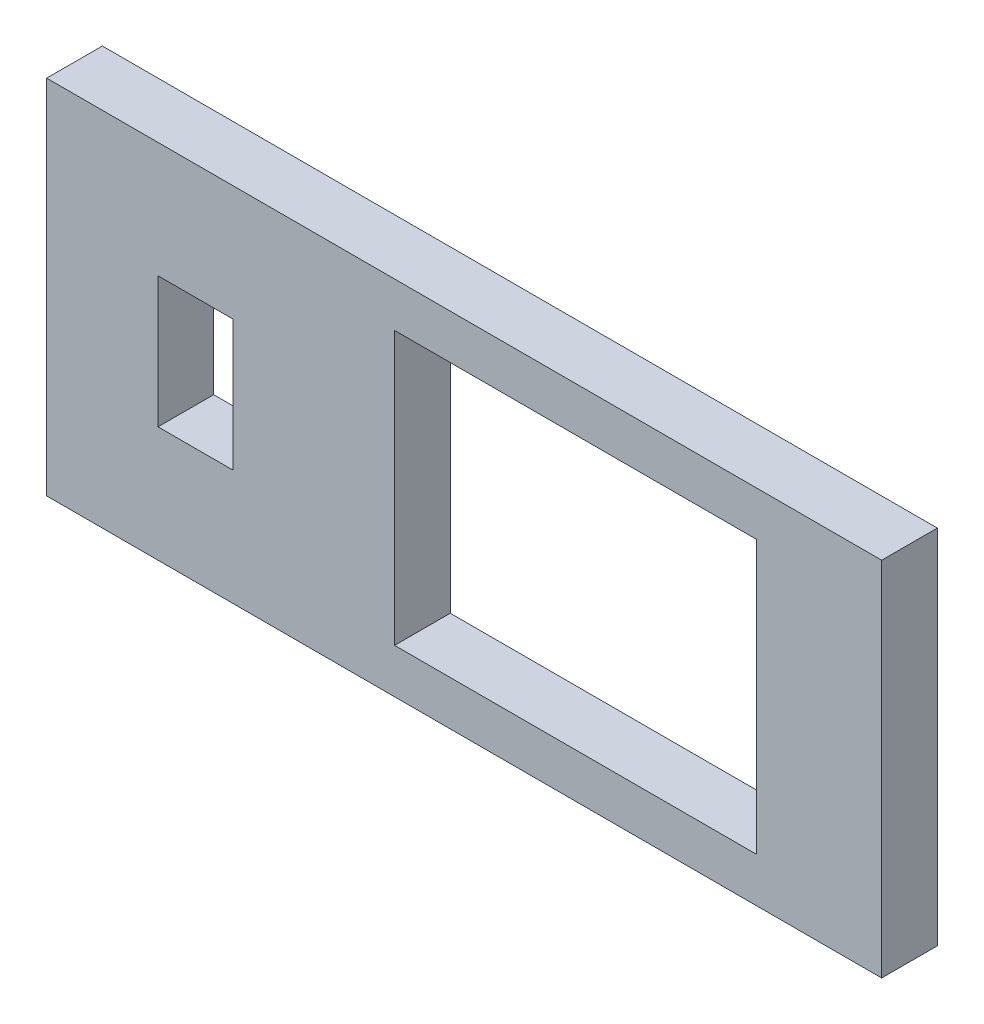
ISO-10303-21;
HEADER;
FILE_DESCRIPTION(('STEP AP214'),'2;1');
FILE_NAME('part.step','',(''),(''),'','','');
FILE_SCHEMA(('AUTOMOTIVE_DESIGN { 1 0 10303 214 1 1 1 1 }'));
ENDSEC;
DATA;
#1=APPLICATION_CONTEXT('core data for automotive mechanical design processes');
#2=APPLICATION_PROTOCOL_DEFINITION('international standard','automotive_design',2000,#1);
#3=PRODUCT_CONTEXT('',#1,'mechanical');
#4=PRODUCT('Part','Part','',(#3));
#5=PRODUCT_RELATED_PRODUCT_CATEGORY('part','',(#4));
#6=PRODUCT_DEFINITION_FORMATION('','',#4);
#7=PRODUCT_DEFINITION_CONTEXT('part definition',#1,'design');
#8=PRODUCT_DEFINITION('design','',#6,#7);
#9=PRODUCT_DEFINITION_SHAPE('','',#8);
#10=(LENGTH_UNIT() NAMED_UNIT(*) SI_UNIT(.MILLI.,.METRE.));
#11=(NAMED_UNIT(*) PLANE_ANGLE_UNIT() SI_UNIT($,.RADIAN.));
#12=(NAMED_UNIT(*) SI_UNIT($,.STERADIAN.) SOLID_ANGLE_UNIT());
#13=UNCERTAINTY_MEASURE_WITH_UNIT(LENGTH_MEASURE(1.E-05),#10,'distance_accuracy_value','');
#14=(GEOMETRIC_REPRESENTATION_CONTEXT(3) GLOBAL_UNCERTAINTY_ASSIGNED_CONTEXT((#13)) GLOBAL_UNIT_ASSIGNED_CONTEXT((#10,
#11,#12)) REPRESENTATION_CONTEXT('',''));
#15=CARTESIAN_POINT('',(0.,0.,0.));
#16=DIRECTION('',(0.,0.,1.));
#17=DIRECTION('',(1.,0.,0.));
#18=AXIS2_PLACEMENT_3D('',#15,#16,#17);
#19=CARTESIAN_POINT('',(0.,130.,0.));
#20=DIRECTION('',(-1.,0.,0.));
#21=DIRECTION('',(0.,0.,1.));
#22=AXIS2_PLACEMENT_3D('',#19,#20,#21);
#23=PLANE('',#22);
#24=DIRECTION('',(0.,0.,-1.));
#25=VECTOR('',#24,1.);
#26=CARTESIAN_POINT('',(0.,0.,0.));
#27=LINE('',#26,#25);
#28=CARTESIAN_POINT('',(0.,0.,20.));
#29=VERTEX_POINT('',#28);
#30=CARTESIAN_POINT('',(0.,0.,0.));
#31=VERTEX_POINT('',#30);
#32=EDGE_CURVE('E180',#29,#31,#27,.T.);
#33=ORIENTED_EDGE('',*,*,#32,.T.);
#34=DIRECTION('',(0.,-1.,0.));
#35=VECTOR('',#34,1.);
#36=CARTESIAN_POINT('',(0.,130.,0.));
#37=LINE('',#36,#35);
#38=CARTESIAN_POINT('',(0.,130.,0.));
#39=VERTEX_POINT('',#38);
#40=EDGE_CURVE('E11',#39,#31,#37,.T.);
#41=ORIENTED_EDGE('',*,*,#40,.F.);
#42=DIRECTION('',(0.,0.,-1.));
#43=VECTOR('',#42,1.);
#44=CARTESIAN_POINT('',(0.,130.,0.));
#45=LINE('',#44,#43);
#46=CARTESIAN_POINT('',(0.,130.,20.));
#47=VERTEX_POINT('',#46);
#48=EDGE_CURVE('E187',#47,#39,#45,.T.);
#49=ORIENTED_EDGE('',*,*,#48,.F.);
#50=DIRECTION('',(0.,-1.,0.));
#51=VECTOR('',#50,1.);
#52=CARTESIAN_POINT('',(0.,130.,20.));
#53=LINE('',#52,#51);
#54=EDGE_CURVE('E197',#47,#29,#53,.T.);
#55=ORIENTED_EDGE('',*,*,#54,.T.);
#56=EDGE_LOOP('',(#33,#41,#49,#55));
#57=FACE_BOUND('',#56,.T.);
#58=ADVANCED_FACE('F32',(#57),#23,.F.);
#59=CARTESIAN_POINT('',(0.,130.,0.));
#60=DIRECTION('',(0.,0.,1.));
#61=DIRECTION('',(1.,0.,0.));
#62=AXIS2_PLACEMENT_3D('',#59,#60,#61);
#63=PLANE('',#62);
#64=DIRECTION('',(0.,-1.,0.));
#65=VECTOR('',#64,1.);
#66=CARTESIAN_POINT('',(-45.,0.,0.));
#67=LINE('',#66,#65);
#68=CARTESIAN_POINT('',(-45.,114.,0.));
#69=VERTEX_POINT('',#68);
#70=CARTESIAN_POINT('',(-45.,16.,0.));
#71=VERTEX_POINT('',#70);
#72=EDGE_CURVE('E125',#69,#71,#67,.T.);
#73=ORIENTED_EDGE('',*,*,#72,.F.);
#74=DIRECTION('',(-1.,0.,0.));
#75=VECTOR('',#74,1.);
#76=CARTESIAN_POINT('',(0.,114.,0.));
#77=LINE('',#76,#75);
#78=CARTESIAN_POINT('',(-175.,114.,0.));
#79=VERTEX_POINT('',#78);
#80=EDGE_CURVE('E122',#69,#79,#77,.T.);
#81=ORIENTED_EDGE('',*,*,#80,.T.);
#82=DIRECTION('',(0.,-1.,0.));
#83=VECTOR('',#82,1.);
#84=CARTESIAN_POINT('',(-175.,0.,0.));
#85=LINE('',#84,#83);
#86=CARTESIAN_POINT('',(-175.,16.,0.));
#87=VERTEX_POINT('',#86);
#88=EDGE_CURVE('E128',#79,#87,#85,.T.);
#89=ORIENTED_EDGE('',*,*,#88,.T.);
#90=DIRECTION('',(-1.,0.,0.));
#91=VECTOR('',#90,1.);
#92=CARTESIAN_POINT('',(0.,16.,0.));
#93=LINE('',#92,#91);
#94=EDGE_CURVE('E132',#71,#87,#93,.T.);
#95=ORIENTED_EDGE('',*,*,#94,.F.);
#96=EDGE_LOOP('',(#73,#81,#89,#95));
#97=FACE_BOUND('',#96,.T.);
#98=DIRECTION('',(1.,0.,0.));
#99=VECTOR('',#98,1.);
#100=CARTESIAN_POINT('',(-260.,41.5,0.));
#101=LINE('',#100,#99);
#102=CARTESIAN_POINT('',(-260.,41.5,0.));
#103=VERTEX_POINT('',#102);
#104=CARTESIAN_POINT('',(-233.,41.5,0.));
#105=VERTEX_POINT('',#104);
#106=EDGE_CURVE('E165',#103,#105,#101,.T.);
#107=ORIENTED_EDGE('',*,*,#106,.T.);
#108=DIRECTION('',(0.,1.,0.));
#109=VECTOR('',#108,1.);
#110=CARTESIAN_POINT('',(-233.,88.5,0.));
#111=LINE('',#110,#109);
#112=CARTESIAN_POINT('',(-233.,88.5,0.));
#113=VERTEX_POINT('',#112);
#114=EDGE_CURVE('E155',#105,#113,#111,.T.);
#115=ORIENTED_EDGE('',*,*,#114,.T.);
#116=DIRECTION('',(-1.,0.,0.));
#117=VECTOR('',#116,1.);
#118=CARTESIAN_POINT('',(-260.,88.5,0.));
#119=LINE('',#118,#117);
#120=CARTESIAN_POINT('',(-260.,88.5,0.));
#121=VERTEX_POINT('',#120);
#122=EDGE_CURVE('E158',#113,#121,#119,.T.);
#123=ORIENTED_EDGE('',*,*,#122,.T.);
#124=DIRECTION('',(0.,-1.,0.));
#125=VECTOR('',#124,1.);
#126=CARTESIAN_POINT('',(-260.,88.5,0.));
#127=LINE('',#126,#125);
#128=EDGE_CURVE('E162',#121,#103,#127,.T.);
#129=ORIENTED_EDGE('',*,*,#128,.T.);
#130=EDGE_LOOP('',(#107,#115,#123,#129));
#131=FACE_BOUND('',#130,.T.);
#132=DIRECTION('',(-1.,0.,0.));
#133=VECTOR('',#132,1.);
#134=CARTESIAN_POINT('',(0.,0.,0.));
#135=LINE('',#134,#133);
#136=CARTESIAN_POINT('',(-300.,0.,0.));
#137=VERTEX_POINT('',#136);
#138=EDGE_CURVE('E200',#31,#137,#135,.T.);
#139=ORIENTED_EDGE('',*,*,#138,.T.);
#140=DIRECTION('',(0.,-1.,0.));
#141=VECTOR('',#140,1.);
#142=CARTESIAN_POINT('',(-300.,130.,0.));
#143=LINE('',#142,#141);
#144=CARTESIAN_POINT('',(-300.,130.,0.));
#145=VERTEX_POINT('',#144);
#146=EDGE_CURVE('E39',#145,#137,#143,.T.);
#147=ORIENTED_EDGE('',*,*,#146,.F.);
#148=DIRECTION('',(-1.,0.,0.));
#149=VECTOR('',#148,1.);
#150=CARTESIAN_POINT('',(0.,130.,0.));
#151=LINE('',#150,#149);
#152=EDGE_CURVE('E190',#39,#145,#151,.T.);
#153=ORIENTED_EDGE('',*,*,#152,.F.);
#154=ORIENTED_EDGE('',*,*,#40,.T.);
#155=EDGE_LOOP('',(#139,#147,#153,#154));
#156=FACE_BOUND('',#155,.T.);
#157=ADVANCED_FACE('F134',(#97,#131,#156),#63,.F.);
#158=CARTESIAN_POINT('',(-300.,130.,0.));
#159=DIRECTION('',(1.,0.,0.));
#160=DIRECTION('',(0.,0.,-1.));
#161=AXIS2_PLACEMENT_3D('',#158,#159,#160);
#162=PLANE('',#161);
#163=DIRECTION('',(0.,0.,1.));
#164=VECTOR('',#163,1.);
#165=CARTESIAN_POINT('',(-300.,0.,0.));
#166=LINE('',#165,#164);
#167=CARTESIAN_POINT('',(-300.,0.,20.0000000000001));
#168=VERTEX_POINT('',#167);
#169=EDGE_CURVE('E202',#137,#168,#166,.T.);
#170=ORIENTED_EDGE('',*,*,#169,.T.);
#171=DIRECTION('',(0.,-1.,0.));
#172=VECTOR('',#171,1.);
#173=CARTESIAN_POINT('',(-300.,130.,20.0000000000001));
#174=LINE('',#173,#172);
#175=CARTESIAN_POINT('',(-300.,130.,20.0000000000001));
#176=VERTEX_POINT('',#175);
#177=EDGE_CURVE('E207',#176,#168,#174,.T.);
#178=ORIENTED_EDGE('',*,*,#177,.F.);
#179=DIRECTION('',(0.,0.,1.));
#180=VECTOR('',#179,1.);
#181=CARTESIAN_POINT('',(-300.,130.,0.));
#182=LINE('',#181,#180);
#183=EDGE_CURVE('E193',#145,#176,#182,.T.);
#184=ORIENTED_EDGE('',*,*,#183,.F.);
#185=ORIENTED_EDGE('',*,*,#146,.T.);
#186=EDGE_LOOP('',(#170,#178,#184,#185));
#187=FACE_BOUND('',#186,.T.);
#188=ADVANCED_FACE('F214',(#187),#162,.F.);
#189=CARTESIAN_POINT('',(0.,130.,20.));
#190=DIRECTION('',(0.,0.,-1.));
#191=DIRECTION('',(-1.,0.,0.));
#192=AXIS2_PLACEMENT_3D('',#189,#190,#191);
#193=PLANE('',#192);
#194=DIRECTION('',(0.,-1.,0.));
#195=VECTOR('',#194,1.);
#196=CARTESIAN_POINT('',(-175.,0.,20.));
#197=LINE('',#196,#195);
#198=CARTESIAN_POINT('',(-175.,114.,20.0000000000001));
#199=VERTEX_POINT('',#198);
#200=CARTESIAN_POINT('',(-175.,16.,20.));
#201=VERTEX_POINT('',#200);
#202=EDGE_CURVE('E145',#199,#201,#197,.T.);
#203=ORIENTED_EDGE('',*,*,#202,.F.);
#204=DIRECTION('',(-1.,0.,0.));
#205=VECTOR('',#204,1.);
#206=CARTESIAN_POINT('',(0.,114.,20.));
#207=LINE('',#206,#205);
#208=CARTESIAN_POINT('',(-45.,114.,20.));
#209=VERTEX_POINT('',#208);
#210=EDGE_CURVE('E54',#209,#199,#207,.T.);
#211=ORIENTED_EDGE('',*,*,#210,.F.);
#212=DIRECTION('',(0.,-1.,0.));
#213=VECTOR('',#212,1.);
#214=CARTESIAN_POINT('',(-45.,0.,20.));
#215=LINE('',#214,#213);
#216=CARTESIAN_POINT('',(-45.,16.,20.));
#217=VERTEX_POINT('',#216);
#218=EDGE_CURVE('E136',#209,#217,#215,.T.);
#219=ORIENTED_EDGE('',*,*,#218,.T.);
#220=DIRECTION('',(-1.,0.,0.));
#221=VECTOR('',#220,1.);
#222=CARTESIAN_POINT('',(0.,16.,20.));
#223=LINE('',#222,#221);
#224=EDGE_CURVE('E139',#217,#201,#223,.T.);
#225=ORIENTED_EDGE('',*,*,#224,.T.);
#226=EDGE_LOOP('',(#203,#211,#219,#225));
#227=FACE_BOUND('',#226,.T.);
#228=DIRECTION('',(-1.,0.,0.));
#229=VECTOR('',#228,1.);
#230=CARTESIAN_POINT('',(-260.,88.5,20.));
#231=LINE('',#230,#229);
#232=CARTESIAN_POINT('',(-233.,88.5,20.0000000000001));
#233=VERTEX_POINT('',#232);
#234=CARTESIAN_POINT('',(-260.,88.5,20.));
#235=VERTEX_POINT('',#234);
#236=EDGE_CURVE('E170',#233,#235,#231,.T.);
#237=ORIENTED_EDGE('',*,*,#236,.F.);
#238=DIRECTION('',(0.,1.,0.));
#239=VECTOR('',#238,1.);
#240=CARTESIAN_POINT('',(-233.,88.5,20.));
#241=LINE('',#240,#239);
#242=CARTESIAN_POINT('',(-233.,41.5,20.));
#243=VERTEX_POINT('',#242);
#244=EDGE_CURVE('E151',#243,#233,#241,.T.);
#245=ORIENTED_EDGE('',*,*,#244,.F.);
#246=DIRECTION('',(1.,0.,0.));
#247=VECTOR('',#246,1.);
#248=CARTESIAN_POINT('',(-260.,41.5,20.));
#249=LINE('',#248,#247);
#250=CARTESIAN_POINT('',(-260.,41.5,20.));
#251=VERTEX_POINT('',#250);
#252=EDGE_CURVE('E159',#251,#243,#249,.T.);
#253=ORIENTED_EDGE('',*,*,#252,.F.);
#254=DIRECTION('',(0.,-1.,0.));
#255=VECTOR('',#254,1.);
#256=CARTESIAN_POINT('',(-260.,88.5,20.));
#257=LINE('',#256,#255);
#258=EDGE_CURVE('E173',#235,#251,#257,.T.);
#259=ORIENTED_EDGE('',*,*,#258,.F.);
#260=EDGE_LOOP('',(#237,#245,#253,#259));
#261=FACE_BOUND('',#260,.T.);
#262=DIRECTION('',(1.,0.,0.));
#263=VECTOR('',#262,1.);
#264=CARTESIAN_POINT('',(0.,0.,20.));
#265=LINE('',#264,#263);
#266=EDGE_CURVE('E191',#168,#29,#265,.T.);
#267=ORIENTED_EDGE('',*,*,#266,.T.);
#268=ORIENTED_EDGE('',*,*,#54,.F.);
#269=DIRECTION('',(1.,0.,0.));
#270=VECTOR('',#269,1.);
#271=CARTESIAN_POINT('',(0.,130.,20.));
#272=LINE('',#271,#270);
#273=EDGE_CURVE('E195',#176,#47,#272,.T.);
#274=ORIENTED_EDGE('',*,*,#273,.F.);
#275=ORIENTED_EDGE('',*,*,#177,.T.);
#276=EDGE_LOOP('',(#267,#268,#274,#275));
#277=FACE_BOUND('',#276,.T.);
#278=ADVANCED_FACE('F223',(#227,#261,#277),#193,.F.);
#279=CARTESIAN_POINT('',(0.,130.,0.));
#280=DIRECTION('',(0.,-1.,0.));
#281=DIRECTION('',(0.,0.,-1.));
#282=AXIS2_PLACEMENT_3D('',#279,#280,#281);
#283=PLANE('',#282);
#284=ORIENTED_EDGE('',*,*,#48,.T.);
#285=ORIENTED_EDGE('',*,*,#152,.T.);
#286=ORIENTED_EDGE('',*,*,#183,.T.);
#287=ORIENTED_EDGE('',*,*,#273,.T.);
#288=EDGE_LOOP('',(#284,#285,#286,#287));
#289=FACE_BOUND('',#288,.T.);
#290=ADVANCED_FACE('F229',(#289),#283,.F.);
#291=CARTESIAN_POINT('',(0.,0.,0.));
#292=DIRECTION('',(0.,-1.,0.));
#293=DIRECTION('',(0.,0.,-1.));
#294=AXIS2_PLACEMENT_3D('',#291,#292,#293);
#295=PLANE('',#294);
#296=ORIENTED_EDGE('',*,*,#32,.F.);
#297=ORIENTED_EDGE('',*,*,#266,.F.);
#298=ORIENTED_EDGE('',*,*,#169,.F.);
#299=ORIENTED_EDGE('',*,*,#138,.F.);
#300=EDGE_LOOP('',(#296,#297,#298,#299));
#301=FACE_BOUND('',#300,.T.);
#302=ADVANCED_FACE('F220',(#301),#295,.T.);
#303=CARTESIAN_POINT('',(-233.,88.5,0.));
#304=DIRECTION('',(1.,0.,0.));
#305=DIRECTION('',(0.,0.,-1.));
#306=AXIS2_PLACEMENT_3D('',#303,#304,#305);
#307=PLANE('',#306);
#308=ORIENTED_EDGE('',*,*,#244,.T.);
#309=DIRECTION('',(0.,0.,1.));
#310=VECTOR('',#309,1.);
#311=CARTESIAN_POINT('',(-233.,88.5,0.));
#312=LINE('',#311,#310);
#313=EDGE_CURVE('E168',#113,#233,#312,.T.);
#314=ORIENTED_EDGE('',*,*,#313,.F.);
#315=ORIENTED_EDGE('',*,*,#114,.F.);
#316=DIRECTION('',(0.,0.,1.));
#317=VECTOR('',#316,1.);
#318=CARTESIAN_POINT('',(-233.,41.5,0.));
#319=LINE('',#318,#317);
#320=EDGE_CURVE('E178',#105,#243,#319,.T.);
#321=ORIENTED_EDGE('',*,*,#320,.T.);
#322=EDGE_LOOP('',(#308,#314,#315,#321));
#323=FACE_BOUND('',#322,.T.);
#324=ADVANCED_FACE('F242',(#323),#307,.F.);
#325=CARTESIAN_POINT('',(-260.,41.5,0.));
#326=DIRECTION('',(0.,-1.,0.));
#327=DIRECTION('',(0.,0.,-1.));
#328=AXIS2_PLACEMENT_3D('',#325,#326,#327);
#329=PLANE('',#328);
#330=ORIENTED_EDGE('',*,*,#252,.T.);
#331=ORIENTED_EDGE('',*,*,#320,.F.);
#332=ORIENTED_EDGE('',*,*,#106,.F.);
#333=DIRECTION('',(0.,0.,1.));
#334=VECTOR('',#333,1.);
#335=CARTESIAN_POINT('',(-260.,41.5,0.));
#336=LINE('',#335,#334);
#337=EDGE_CURVE('E181',#103,#251,#336,.T.);
#338=ORIENTED_EDGE('',*,*,#337,.T.);
#339=EDGE_LOOP('',(#330,#331,#332,#338));
#340=FACE_BOUND('',#339,.T.);
#341=ADVANCED_FACE('F247',(#340),#329,.F.);
#342=CARTESIAN_POINT('',(-260.,88.5,0.));
#343=DIRECTION('',(-1.,0.,0.));
#344=DIRECTION('',(0.,0.,1.));
#345=AXIS2_PLACEMENT_3D('',#342,#343,#344);
#346=PLANE('',#345);
#347=ORIENTED_EDGE('',*,*,#258,.T.);
#348=ORIENTED_EDGE('',*,*,#337,.F.);
#349=ORIENTED_EDGE('',*,*,#128,.F.);
#350=DIRECTION('',(0.,0.,1.));
#351=VECTOR('',#350,1.);
#352=CARTESIAN_POINT('',(-260.,88.5,0.));
#353=LINE('',#352,#351);
#354=EDGE_CURVE('E183',#121,#235,#353,.T.);
#355=ORIENTED_EDGE('',*,*,#354,.T.);
#356=EDGE_LOOP('',(#347,#348,#349,#355));
#357=FACE_BOUND('',#356,.T.);
#358=ADVANCED_FACE('F252',(#357),#346,.F.);
#359=CARTESIAN_POINT('',(-260.,88.5,0.));
#360=DIRECTION('',(0.,1.,0.));
#361=DIRECTION('',(0.,0.,1.));
#362=AXIS2_PLACEMENT_3D('',#359,#360,#361);
#363=PLANE('',#362);
#364=ORIENTED_EDGE('',*,*,#236,.T.);
#365=ORIENTED_EDGE('',*,*,#354,.F.);
#366=ORIENTED_EDGE('',*,*,#122,.F.);
#367=ORIENTED_EDGE('',*,*,#313,.T.);
#368=EDGE_LOOP('',(#364,#365,#366,#367));
#369=FACE_BOUND('',#368,.T.);
#370=ADVANCED_FACE('F249',(#369),#363,.F.);
#371=CARTESIAN_POINT('',(0.,114.,0.));
#372=DIRECTION('',(0.,1.,0.));
#373=DIRECTION('',(0.,0.,1.));
#374=AXIS2_PLACEMENT_3D('',#371,#372,#373);
#375=PLANE('',#374);
#376=ORIENTED_EDGE('',*,*,#210,.T.);
#377=DIRECTION('',(0.,0.,1.));
#378=VECTOR('',#377,1.);
#379=CARTESIAN_POINT('',(-175.,114.,0.));
#380=LINE('',#379,#378);
#381=EDGE_CURVE('E119',#79,#199,#380,.T.);
#382=ORIENTED_EDGE('',*,*,#381,.F.);
#383=ORIENTED_EDGE('',*,*,#80,.F.);
#384=DIRECTION('',(0.,0.,1.));
#385=VECTOR('',#384,1.);
#386=CARTESIAN_POINT('',(-45.,114.,0.));
#387=LINE('',#386,#385);
#388=EDGE_CURVE('E149',#69,#209,#387,.T.);
#389=ORIENTED_EDGE('',*,*,#388,.T.);
#390=EDGE_LOOP('',(#376,#382,#383,#389));
#391=FACE_BOUND('',#390,.T.);
#392=ADVANCED_FACE('F120',(#391),#375,.F.);
#393=CARTESIAN_POINT('',(-45.,0.,0.));
#394=DIRECTION('',(-1.,0.,0.));
#395=DIRECTION('',(0.,-1.,0.));
#396=AXIS2_PLACEMENT_3D('',#393,#394,#395);
#397=PLANE('',#396);
#398=ORIENTED_EDGE('',*,*,#218,.F.);
#399=ORIENTED_EDGE('',*,*,#388,.F.);
#400=ORIENTED_EDGE('',*,*,#72,.T.);
#401=DIRECTION('',(0.,0.,1.));
#402=VECTOR('',#401,1.);
#403=CARTESIAN_POINT('',(-45.,16.,0.));
#404=LINE('',#403,#402);
#405=EDGE_CURVE('E152',#71,#217,#404,.T.);
#406=ORIENTED_EDGE('',*,*,#405,.T.);
#407=EDGE_LOOP('',(#398,#399,#400,#406));
#408=FACE_BOUND('',#407,.T.);
#409=ADVANCED_FACE('F262',(#408),#397,.T.);
#410=CARTESIAN_POINT('',(0.,16.,0.));
#411=DIRECTION('',(0.,1.,0.));
#412=DIRECTION('',(-1.,0.,0.));
#413=AXIS2_PLACEMENT_3D('',#410,#411,#412);
#414=PLANE('',#413);
#415=ORIENTED_EDGE('',*,*,#224,.F.);
#416=ORIENTED_EDGE('',*,*,#405,.F.);
#417=ORIENTED_EDGE('',*,*,#94,.T.);
#418=DIRECTION('',(0.,0.,1.));
#419=VECTOR('',#418,1.);
#420=CARTESIAN_POINT('',(-175.,16.,0.));
#421=LINE('',#420,#419);
#422=EDGE_CURVE('E46',#87,#201,#421,.T.);
#423=ORIENTED_EDGE('',*,*,#422,.T.);
#424=EDGE_LOOP('',(#415,#416,#417,#423));
#425=FACE_BOUND('',#424,.T.);
#426=ADVANCED_FACE('F265',(#425),#414,.T.);
#427=CARTESIAN_POINT('',(-175.,0.,0.));
#428=DIRECTION('',(-1.,0.,0.));
#429=DIRECTION('',(0.,0.,1.));
#430=AXIS2_PLACEMENT_3D('',#427,#428,#429);
#431=PLANE('',#430);
#432=ORIENTED_EDGE('',*,*,#202,.T.);
#433=ORIENTED_EDGE('',*,*,#422,.F.);
#434=ORIENTED_EDGE('',*,*,#88,.F.);
#435=ORIENTED_EDGE('',*,*,#381,.T.);
#436=EDGE_LOOP('',(#432,#433,#434,#435));
#437=FACE_BOUND('',#436,.T.);
#438=ADVANCED_FACE('F129',(#437),#431,.F.);
#439=CLOSED_SHELL('',(#58,#157,#188,#278,#290,#302,#324,#341,#358,#370,#392,#409,#426,#438));
#440=MANIFOLD_SOLID_BREP('B2',#439);
#441=ADVANCED_BREP_SHAPE_REPRESENTATION('',(#18,#440),#14);
#442=SHAPE_DEFINITION_REPRESENTATION(#9,#441);
ENDSEC;
END-ISO-10303-21;
